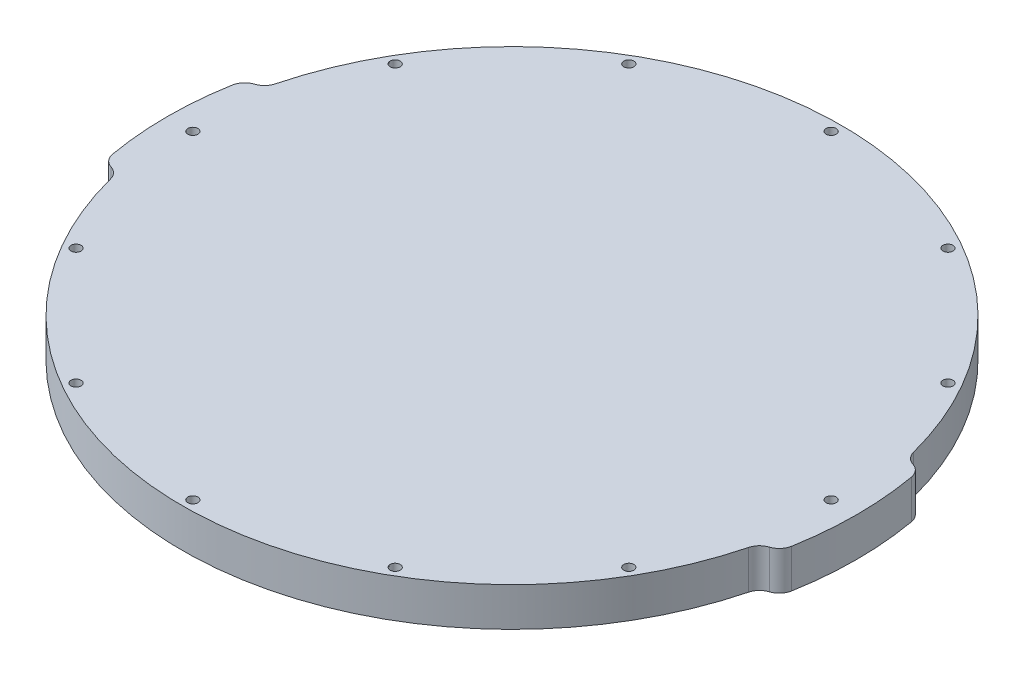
ISO-10303-21;
HEADER;
FILE_DESCRIPTION(('STEP AP214'),'2;1');
FILE_NAME('part.step','',(''),(''),'','','');
FILE_SCHEMA(('AUTOMOTIVE_DESIGN { 1 0 10303 214 1 1 1 1 }'));
ENDSEC;
DATA;
#1=APPLICATION_CONTEXT('core data for automotive mechanical design processes');
#2=APPLICATION_PROTOCOL_DEFINITION('international standard','automotive_design',2000,#1);
#3=PRODUCT_CONTEXT('',#1,'mechanical');
#4=PRODUCT('Part','Part','',(#3));
#5=PRODUCT_RELATED_PRODUCT_CATEGORY('part','',(#4));
#6=PRODUCT_DEFINITION_FORMATION('','',#4);
#7=PRODUCT_DEFINITION_CONTEXT('part definition',#1,'design');
#8=PRODUCT_DEFINITION('design','',#6,#7);
#9=PRODUCT_DEFINITION_SHAPE('','',#8);
#10=(LENGTH_UNIT() NAMED_UNIT(*) SI_UNIT(.MILLI.,.METRE.));
#11=(NAMED_UNIT(*) PLANE_ANGLE_UNIT() SI_UNIT($,.RADIAN.));
#12=(NAMED_UNIT(*) SI_UNIT($,.STERADIAN.) SOLID_ANGLE_UNIT());
#13=UNCERTAINTY_MEASURE_WITH_UNIT(LENGTH_MEASURE(1.E-05),#10,'distance_accuracy_value','');
#14=(GEOMETRIC_REPRESENTATION_CONTEXT(3) GLOBAL_UNCERTAINTY_ASSIGNED_CONTEXT((#13)) GLOBAL_UNIT_ASSIGNED_CONTEXT((#10,
#11,#12)) REPRESENTATION_CONTEXT('',''));
#15=CARTESIAN_POINT('',(0.,0.,0.));
#16=DIRECTION('',(0.,0.,1.));
#17=DIRECTION('',(1.,0.,0.));
#18=AXIS2_PLACEMENT_3D('',#15,#16,#17);
#19=CARTESIAN_POINT('',(-53.1549984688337,12.7,-9.37266038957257));
#20=DIRECTION('',(0.,-1.,0.));
#21=DIRECTION('',(0.,0.,-1.));
#22=AXIS2_PLACEMENT_3D('',#19,#20,#21);
#23=PLANE('',#22);
#24=CARTESIAN_POINT('',(-90.5429559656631,12.7,-52.2749999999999));
#25=DIRECTION('',(0.,1.,0.));
#26=DIRECTION('',(0.,0.,1.));
#27=AXIS2_PLACEMENT_3D('',#24,#25,#26);
#28=CIRCLE('',#27,1.65000000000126);
#29=CARTESIAN_POINT('',(-90.5429559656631,12.7,-50.6249999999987));
#30=VERTEX_POINT('',#29);
#31=EDGE_CURVE('E356',#30,#30,#28,.T.);
#32=ORIENTED_EDGE('',*,*,#31,.F.);
#33=EDGE_LOOP('',(#32));
#34=FACE_BOUND('',#33,.T.);
#35=CARTESIAN_POINT('',(-90.542955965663,12.7,52.2750000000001));
#36=DIRECTION('',(0.,1.,0.));
#37=DIRECTION('',(0.,0.,1.));
#38=AXIS2_PLACEMENT_3D('',#35,#36,#37);
#39=CIRCLE('',#38,1.65000000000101);
#40=CARTESIAN_POINT('',(-90.542955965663,12.7,53.9250000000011));
#41=VERTEX_POINT('',#40);
#42=EDGE_CURVE('E344',#41,#41,#39,.T.);
#43=ORIENTED_EDGE('',*,*,#42,.F.);
#44=EDGE_LOOP('',(#43));
#45=FACE_BOUND('',#44,.T.);
#46=CARTESIAN_POINT('',(0.,12.7,104.55));
#47=DIRECTION('',(0.,1.,0.));
#48=DIRECTION('',(0.,0.,1.));
#49=AXIS2_PLACEMENT_3D('',#46,#47,#48);
#50=CIRCLE('',#49,1.65000000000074);
#51=CARTESIAN_POINT('',(0.,12.7,106.200000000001));
#52=VERTEX_POINT('',#51);
#53=EDGE_CURVE('E332',#52,#52,#50,.T.);
#54=ORIENTED_EDGE('',*,*,#53,.F.);
#55=EDGE_LOOP('',(#54));
#56=FACE_BOUND('',#55,.T.);
#57=CARTESIAN_POINT('',(90.5429559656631,12.7,52.275));
#58=DIRECTION('',(0.,1.,0.));
#59=DIRECTION('',(0.,0.,1.));
#60=AXIS2_PLACEMENT_3D('',#57,#58,#59);
#61=CIRCLE('',#60,1.65000000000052);
#62=CARTESIAN_POINT('',(90.5429559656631,12.7,53.9250000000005));
#63=VERTEX_POINT('',#62);
#64=EDGE_CURVE('E320',#63,#63,#61,.T.);
#65=ORIENTED_EDGE('',*,*,#64,.F.);
#66=EDGE_LOOP('',(#65));
#67=FACE_BOUND('',#66,.T.);
#68=CARTESIAN_POINT('',(90.5429559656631,12.7,-52.275));
#69=DIRECTION('',(0.,1.,0.));
#70=DIRECTION('',(0.,0.,1.));
#71=AXIS2_PLACEMENT_3D('',#68,#69,#70);
#72=CIRCLE('',#71,1.65000000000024);
#73=CARTESIAN_POINT('',(90.5429559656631,12.7,-50.6249999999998));
#74=VERTEX_POINT('',#73);
#75=EDGE_CURVE('E308',#74,#74,#72,.T.);
#76=ORIENTED_EDGE('',*,*,#75,.F.);
#77=EDGE_LOOP('',(#76));
#78=FACE_BOUND('',#77,.T.);
#79=CARTESIAN_POINT('',(0.,12.7,-104.55));
#80=DIRECTION('',(0.,1.,0.));
#81=DIRECTION('',(0.,0.,1.));
#82=AXIS2_PLACEMENT_3D('',#79,#80,#81);
#83=CIRCLE('',#82,1.65);
#84=CARTESIAN_POINT('',(0.,12.7,-102.9));
#85=VERTEX_POINT('',#84);
#86=EDGE_CURVE('E276',#85,#85,#83,.T.);
#87=ORIENTED_EDGE('',*,*,#86,.F.);
#88=EDGE_LOOP('',(#87));
#89=FACE_BOUND('',#88,.T.);
#90=CARTESIAN_POINT('',(0.,12.7,0.));
#91=DIRECTION('',(0.,1.,0.));
#92=DIRECTION('',(0.,0.,-1.));
#93=AXIS2_PLACEMENT_3D('',#90,#91,#92);
#94=CIRCLE('',#93,107.95);
#95=CARTESIAN_POINT('',(104.513991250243,12.7,-27.0190327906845));
#96=VERTEX_POINT('',#95);
#97=CARTESIAN_POINT('',(-104.513991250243,12.7,-27.0190327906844));
#98=VERTEX_POINT('',#97);
#99=EDGE_CURVE('E271',#96,#98,#94,.T.);
#100=ORIENTED_EDGE('',*,*,#99,.T.);
#101=CARTESIAN_POINT('',(-109.354843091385,12.7,-28.2704933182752));
#102=DIRECTION('',(0.,-1.,0.));
#103=DIRECTION('',(0.,0.,-1.));
#104=AXIS2_PLACEMENT_3D('',#101,#102,#103);
#105=CIRCLE('',#104,5.);
#106=CARTESIAN_POINT('',(-107.832420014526,12.7,-23.5079070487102));
#107=VERTEX_POINT('',#106);
#108=EDGE_CURVE('E127',#98,#107,#105,.T.);
#109=ORIENTED_EDGE('',*,*,#108,.T.);
#110=CARTESIAN_POINT('',(-106.309996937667,12.7,-18.7453207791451));
#111=DIRECTION('',(0.,1.,0.));
#112=DIRECTION('',(0.,0.,-1.));
#113=AXIS2_PLACEMENT_3D('',#110,#111,#112);
#114=CIRCLE('',#113,5.00000000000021);
#115=CARTESIAN_POINT('',(-111.234035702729,12.7,-19.6135616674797));
#116=VERTEX_POINT('',#115);
#117=EDGE_CURVE('E120',#107,#116,#114,.T.);
#118=ORIENTED_EDGE('',*,*,#117,.T.);
#119=CARTESIAN_POINT('',(0.,12.7,0.));
#120=DIRECTION('',(0.,1.,0.));
#121=DIRECTION('',(0.,0.,-1.));
#122=AXIS2_PLACEMENT_3D('',#119,#120,#121);
#123=CIRCLE('',#122,112.95);
#124=CARTESIAN_POINT('',(-111.234035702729,12.7,19.6135616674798));
#125=VERTEX_POINT('',#124);
#126=EDGE_CURVE('E124',#116,#125,#123,.T.);
#127=ORIENTED_EDGE('',*,*,#126,.T.);
#128=CARTESIAN_POINT('',(-106.309996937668,12.7,18.7453207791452));
#129=DIRECTION('',(0.,1.,0.));
#130=DIRECTION('',(0.,0.,1.));
#131=AXIS2_PLACEMENT_3D('',#128,#129,#130);
#132=CIRCLE('',#131,5.00000000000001);
#133=CARTESIAN_POINT('',(-107.832420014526,12.7,23.5079070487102));
#134=VERTEX_POINT('',#133);
#135=EDGE_CURVE('E140',#125,#134,#132,.T.);
#136=ORIENTED_EDGE('',*,*,#135,.T.);
#137=CARTESIAN_POINT('',(-109.354843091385,12.7,28.2704933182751));
#138=DIRECTION('',(0.,-1.,0.));
#139=DIRECTION('',(0.,0.,-1.));
#140=AXIS2_PLACEMENT_3D('',#137,#138,#139);
#141=CIRCLE('',#140,5.);
#142=CARTESIAN_POINT('',(-104.513991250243,12.7,27.0190327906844));
#143=VERTEX_POINT('',#142);
#144=EDGE_CURVE('E11',#134,#143,#141,.T.);
#145=ORIENTED_EDGE('',*,*,#144,.T.);
#146=CARTESIAN_POINT('',(0.,12.7,-4.92661467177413E-13));
#147=DIRECTION('',(0.,1.,0.));
#148=DIRECTION('',(0.,0.,-1.));
#149=AXIS2_PLACEMENT_3D('',#146,#147,#148);
#150=CIRCLE('',#149,107.95);
#151=CARTESIAN_POINT('',(104.513991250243,12.7,27.0190327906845));
#152=VERTEX_POINT('',#151);
#153=EDGE_CURVE('E258',#143,#152,#150,.T.);
#154=ORIENTED_EDGE('',*,*,#153,.T.);
#155=CARTESIAN_POINT('',(109.354843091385,12.7,28.2704933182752));
#156=DIRECTION('',(0.,-1.,0.));
#157=DIRECTION('',(0.,0.,-1.));
#158=AXIS2_PLACEMENT_3D('',#155,#156,#157);
#159=CIRCLE('',#158,5.);
#160=CARTESIAN_POINT('',(107.832420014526,12.7,23.5079070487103));
#161=VERTEX_POINT('',#160);
#162=EDGE_CURVE('E171',#152,#161,#159,.T.);
#163=ORIENTED_EDGE('',*,*,#162,.T.);
#164=CARTESIAN_POINT('',(106.309996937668,12.7,18.7453207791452));
#165=DIRECTION('',(0.,1.,0.));
#166=DIRECTION('',(0.,0.,-1.));
#167=AXIS2_PLACEMENT_3D('',#164,#165,#166);
#168=CIRCLE('',#167,5.00000000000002);
#169=CARTESIAN_POINT('',(111.234035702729,12.7,19.6135616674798));
#170=VERTEX_POINT('',#169);
#171=EDGE_CURVE('E255',#161,#170,#168,.T.);
#172=ORIENTED_EDGE('',*,*,#171,.T.);
#173=CARTESIAN_POINT('',(-1.29063426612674E-12,12.7,0.));
#174=DIRECTION('',(0.,1.,0.));
#175=DIRECTION('',(0.,0.,1.));
#176=AXIS2_PLACEMENT_3D('',#173,#174,#175);
#177=CIRCLE('',#176,112.950000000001);
#178=CARTESIAN_POINT('',(111.234035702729,12.7,-19.6135616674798));
#179=VERTEX_POINT('',#178);
#180=EDGE_CURVE('E262',#170,#179,#177,.T.);
#181=ORIENTED_EDGE('',*,*,#180,.T.);
#182=CARTESIAN_POINT('',(106.309996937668,12.7,-18.7453207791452));
#183=DIRECTION('',(0.,1.,0.));
#184=DIRECTION('',(0.,0.,1.));
#185=AXIS2_PLACEMENT_3D('',#182,#183,#184);
#186=CIRCLE('',#185,5.);
#187=CARTESIAN_POINT('',(107.832420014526,12.7,-23.5079070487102));
#188=VERTEX_POINT('',#187);
#189=EDGE_CURVE('E264',#179,#188,#186,.T.);
#190=ORIENTED_EDGE('',*,*,#189,.T.);
#191=CARTESIAN_POINT('',(109.354843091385,12.7,-28.2704933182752));
#192=DIRECTION('',(0.,-1.,0.));
#193=DIRECTION('',(0.,0.,-1.));
#194=AXIS2_PLACEMENT_3D('',#191,#192,#193);
#195=CIRCLE('',#194,5.);
#196=EDGE_CURVE('E175',#188,#96,#195,.T.);
#197=ORIENTED_EDGE('',*,*,#196,.T.);
#198=EDGE_LOOP('',(#100,#109,#118,#127,#136,#145,#154,#163,#172,#181,#190,#197));
#199=FACE_BOUND('',#198,.T.);
#200=CARTESIAN_POINT('',(52.275,12.7,-90.5429559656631));
#201=DIRECTION('',(0.,1.,0.));
#202=DIRECTION('',(0.,0.,1.));
#203=AXIS2_PLACEMENT_3D('',#200,#201,#202);
#204=CIRCLE('',#203,1.65000000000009);
#205=CARTESIAN_POINT('',(52.275,12.7,-88.892955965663));
#206=VERTEX_POINT('',#205);
#207=EDGE_CURVE('E302',#206,#206,#204,.T.);
#208=ORIENTED_EDGE('',*,*,#207,.F.);
#209=EDGE_LOOP('',(#208));
#210=FACE_BOUND('',#209,.T.);
#211=CARTESIAN_POINT('',(104.55,12.7,0.));
#212=DIRECTION('',(0.,1.,0.));
#213=DIRECTION('',(0.,0.,1.));
#214=AXIS2_PLACEMENT_3D('',#211,#212,#213);
#215=CIRCLE('',#214,1.65000000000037);
#216=CARTESIAN_POINT('',(104.55,12.7,1.65000000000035));
#217=VERTEX_POINT('',#216);
#218=EDGE_CURVE('E314',#217,#217,#215,.T.);
#219=ORIENTED_EDGE('',*,*,#218,.F.);
#220=EDGE_LOOP('',(#219));
#221=FACE_BOUND('',#220,.T.);
#222=CARTESIAN_POINT('',(52.2750000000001,12.7,90.542955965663));
#223=DIRECTION('',(0.,1.,0.));
#224=DIRECTION('',(0.,0.,1.));
#225=AXIS2_PLACEMENT_3D('',#222,#223,#224);
#226=CIRCLE('',#225,1.65000000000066);
#227=CARTESIAN_POINT('',(52.2750000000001,12.7,92.1929559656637));
#228=VERTEX_POINT('',#227);
#229=EDGE_CURVE('E326',#228,#228,#226,.T.);
#230=ORIENTED_EDGE('',*,*,#229,.F.);
#231=EDGE_LOOP('',(#230));
#232=FACE_BOUND('',#231,.T.);
#233=CARTESIAN_POINT('',(-52.2749999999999,12.7,90.5429559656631));
#234=DIRECTION('',(0.,1.,0.));
#235=DIRECTION('',(0.,0.,1.));
#236=AXIS2_PLACEMENT_3D('',#233,#234,#235);
#237=CIRCLE('',#236,1.65000000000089);
#238=CARTESIAN_POINT('',(-52.2749999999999,12.7,92.192955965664));
#239=VERTEX_POINT('',#238);
#240=EDGE_CURVE('E338',#239,#239,#237,.T.);
#241=ORIENTED_EDGE('',*,*,#240,.F.);
#242=EDGE_LOOP('',(#241));
#243=FACE_BOUND('',#242,.T.);
#244=CARTESIAN_POINT('',(-104.55,12.7,0.));
#245=DIRECTION('',(0.,1.,0.));
#246=DIRECTION('',(0.,0.,1.));
#247=AXIS2_PLACEMENT_3D('',#244,#245,#246);
#248=CIRCLE('',#247,1.65000000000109);
#249=CARTESIAN_POINT('',(-104.55,12.7,1.65000000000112));
#250=VERTEX_POINT('',#249);
#251=EDGE_CURVE('E350',#250,#250,#248,.T.);
#252=ORIENTED_EDGE('',*,*,#251,.F.);
#253=EDGE_LOOP('',(#252));
#254=FACE_BOUND('',#253,.T.);
#255=CARTESIAN_POINT('',(-52.275,12.7,-90.542955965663));
#256=DIRECTION('',(0.,1.,0.));
#257=DIRECTION('',(0.,0.,1.));
#258=AXIS2_PLACEMENT_3D('',#255,#256,#257);
#259=CIRCLE('',#258,1.65000000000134);
#260=CARTESIAN_POINT('',(-52.275,12.7,-88.8929559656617));
#261=VERTEX_POINT('',#260);
#262=EDGE_CURVE('E362',#261,#261,#259,.T.);
#263=ORIENTED_EDGE('',*,*,#262,.F.);
#264=EDGE_LOOP('',(#263));
#265=FACE_BOUND('',#264,.T.);
#266=ADVANCED_FACE('F32',(#34,#45,#56,#67,#78,#89,#199,#210,#221,#232,#243,#254,#265),#23,.F.);
#267=CARTESIAN_POINT('',(-53.1549984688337,0.,-9.37266038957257));
#268=DIRECTION('',(0.,-1.,0.));
#269=DIRECTION('',(0.,0.,-1.));
#270=AXIS2_PLACEMENT_3D('',#267,#268,#269);
#271=PLANE('',#270);
#272=CARTESIAN_POINT('',(-90.5429559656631,0.,-52.2749999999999));
#273=DIRECTION('',(0.,1.,0.));
#274=DIRECTION('',(0.,0.,1.));
#275=AXIS2_PLACEMENT_3D('',#272,#273,#274);
#276=CIRCLE('',#275,1.65000000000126);
#277=CARTESIAN_POINT('',(-90.5429559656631,0.,-50.6249999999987));
#278=VERTEX_POINT('',#277);
#279=EDGE_CURVE('E359',#278,#278,#276,.T.);
#280=ORIENTED_EDGE('',*,*,#279,.T.);
#281=EDGE_LOOP('',(#280));
#282=FACE_BOUND('',#281,.T.);
#283=CARTESIAN_POINT('',(-90.542955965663,0.,52.2750000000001));
#284=DIRECTION('',(0.,1.,0.));
#285=DIRECTION('',(0.,0.,1.));
#286=AXIS2_PLACEMENT_3D('',#283,#284,#285);
#287=CIRCLE('',#286,1.65000000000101);
#288=CARTESIAN_POINT('',(-90.542955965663,0.,53.9250000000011));
#289=VERTEX_POINT('',#288);
#290=EDGE_CURVE('E347',#289,#289,#287,.T.);
#291=ORIENTED_EDGE('',*,*,#290,.T.);
#292=EDGE_LOOP('',(#291));
#293=FACE_BOUND('',#292,.T.);
#294=CARTESIAN_POINT('',(0.,0.,104.55));
#295=DIRECTION('',(0.,1.,0.));
#296=DIRECTION('',(0.,0.,1.));
#297=AXIS2_PLACEMENT_3D('',#294,#295,#296);
#298=CIRCLE('',#297,1.65000000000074);
#299=CARTESIAN_POINT('',(0.,0.,106.200000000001));
#300=VERTEX_POINT('',#299);
#301=EDGE_CURVE('E335',#300,#300,#298,.T.);
#302=ORIENTED_EDGE('',*,*,#301,.T.);
#303=EDGE_LOOP('',(#302));
#304=FACE_BOUND('',#303,.T.);
#305=CARTESIAN_POINT('',(90.5429559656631,0.,52.275));
#306=DIRECTION('',(0.,1.,0.));
#307=DIRECTION('',(0.,0.,1.));
#308=AXIS2_PLACEMENT_3D('',#305,#306,#307);
#309=CIRCLE('',#308,1.65000000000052);
#310=CARTESIAN_POINT('',(90.5429559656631,0.,53.9250000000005));
#311=VERTEX_POINT('',#310);
#312=EDGE_CURVE('E323',#311,#311,#309,.T.);
#313=ORIENTED_EDGE('',*,*,#312,.T.);
#314=EDGE_LOOP('',(#313));
#315=FACE_BOUND('',#314,.T.);
#316=CARTESIAN_POINT('',(90.5429559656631,0.,-52.275));
#317=DIRECTION('',(0.,1.,0.));
#318=DIRECTION('',(0.,0.,1.));
#319=AXIS2_PLACEMENT_3D('',#316,#317,#318);
#320=CIRCLE('',#319,1.65000000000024);
#321=CARTESIAN_POINT('',(90.5429559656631,0.,-50.6249999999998));
#322=VERTEX_POINT('',#321);
#323=EDGE_CURVE('E311',#322,#322,#320,.T.);
#324=ORIENTED_EDGE('',*,*,#323,.T.);
#325=EDGE_LOOP('',(#324));
#326=FACE_BOUND('',#325,.T.);
#327=CARTESIAN_POINT('',(0.,0.,-104.55));
#328=DIRECTION('',(0.,1.,0.));
#329=DIRECTION('',(0.,0.,1.));
#330=AXIS2_PLACEMENT_3D('',#327,#328,#329);
#331=CIRCLE('',#330,1.65);
#332=CARTESIAN_POINT('',(0.,0.,-102.9));
#333=VERTEX_POINT('',#332);
#334=EDGE_CURVE('E299',#333,#333,#331,.T.);
#335=ORIENTED_EDGE('',*,*,#334,.T.);
#336=EDGE_LOOP('',(#335));
#337=FACE_BOUND('',#336,.T.);
#338=CARTESIAN_POINT('',(-106.309996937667,0.,-18.7453207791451));
#339=DIRECTION('',(0.,1.,0.));
#340=DIRECTION('',(0.,0.,-1.));
#341=AXIS2_PLACEMENT_3D('',#338,#339,#340);
#342=CIRCLE('',#341,5.00000000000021);
#343=CARTESIAN_POINT('',(-107.832420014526,0.,-23.5079070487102));
#344=VERTEX_POINT('',#343);
#345=CARTESIAN_POINT('',(-111.234035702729,0.,-19.6135616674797));
#346=VERTEX_POINT('',#345);
#347=EDGE_CURVE('E144',#344,#346,#342,.T.);
#348=ORIENTED_EDGE('',*,*,#347,.F.);
#349=CARTESIAN_POINT('',(-109.354843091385,0.,-28.2704933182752));
#350=DIRECTION('',(0.,-1.,0.));
#351=DIRECTION('',(0.,0.,-1.));
#352=AXIS2_PLACEMENT_3D('',#349,#350,#351);
#353=CIRCLE('',#352,5.);
#354=CARTESIAN_POINT('',(-104.513991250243,0.,-27.0190327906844));
#355=VERTEX_POINT('',#354);
#356=EDGE_CURVE('E177',#344,#355,#353,.F.);
#357=ORIENTED_EDGE('',*,*,#356,.T.);
#358=CARTESIAN_POINT('',(0.,0.,0.));
#359=DIRECTION('',(0.,1.,0.));
#360=DIRECTION('',(0.,0.,-1.));
#361=AXIS2_PLACEMENT_3D('',#358,#359,#360);
#362=CIRCLE('',#361,107.95);
#363=CARTESIAN_POINT('',(104.513991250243,0.,-27.0190327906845));
#364=VERTEX_POINT('',#363);
#365=EDGE_CURVE('E132',#364,#355,#362,.T.);
#366=ORIENTED_EDGE('',*,*,#365,.F.);
#367=CARTESIAN_POINT('',(109.354843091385,0.,-28.2704933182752));
#368=DIRECTION('',(0.,-1.,0.));
#369=DIRECTION('',(0.,0.,-1.));
#370=AXIS2_PLACEMENT_3D('',#367,#368,#369);
#371=CIRCLE('',#370,5.);
#372=CARTESIAN_POINT('',(107.832420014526,0.,-23.5079070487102));
#373=VERTEX_POINT('',#372);
#374=EDGE_CURVE('E173',#364,#373,#371,.F.);
#375=ORIENTED_EDGE('',*,*,#374,.T.);
#376=CARTESIAN_POINT('',(106.309996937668,0.,-18.7453207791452));
#377=DIRECTION('',(0.,1.,0.));
#378=DIRECTION('',(0.,0.,1.));
#379=AXIS2_PLACEMENT_3D('',#376,#377,#378);
#380=CIRCLE('',#379,5.);
#381=CARTESIAN_POINT('',(111.234035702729,0.,-19.6135616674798));
#382=VERTEX_POINT('',#381);
#383=EDGE_CURVE('E189',#382,#373,#380,.T.);
#384=ORIENTED_EDGE('',*,*,#383,.F.);
#385=CARTESIAN_POINT('',(-1.29063426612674E-12,0.,0.));
#386=DIRECTION('',(0.,1.,0.));
#387=DIRECTION('',(0.,0.,1.));
#388=AXIS2_PLACEMENT_3D('',#385,#386,#387);
#389=CIRCLE('',#388,112.950000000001);
#390=CARTESIAN_POINT('',(111.234035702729,0.,19.6135616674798));
#391=VERTEX_POINT('',#390);
#392=EDGE_CURVE('E285',#391,#382,#389,.T.);
#393=ORIENTED_EDGE('',*,*,#392,.F.);
#394=CARTESIAN_POINT('',(106.309996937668,0.,18.7453207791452));
#395=DIRECTION('',(0.,1.,0.));
#396=DIRECTION('',(0.,0.,-1.));
#397=AXIS2_PLACEMENT_3D('',#394,#395,#396);
#398=CIRCLE('',#397,5.00000000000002);
#399=CARTESIAN_POINT('',(107.832420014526,0.,23.5079070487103));
#400=VERTEX_POINT('',#399);
#401=EDGE_CURVE('E283',#400,#391,#398,.T.);
#402=ORIENTED_EDGE('',*,*,#401,.F.);
#403=CARTESIAN_POINT('',(109.354843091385,0.,28.2704933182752));
#404=DIRECTION('',(0.,-1.,0.));
#405=DIRECTION('',(0.,0.,-1.));
#406=AXIS2_PLACEMENT_3D('',#403,#404,#405);
#407=CIRCLE('',#406,5.);
#408=CARTESIAN_POINT('',(104.513991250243,0.,27.0190327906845));
#409=VERTEX_POINT('',#408);
#410=EDGE_CURVE('E169',#400,#409,#407,.F.);
#411=ORIENTED_EDGE('',*,*,#410,.T.);
#412=CARTESIAN_POINT('',(0.,0.,-4.92661467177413E-13));
#413=DIRECTION('',(0.,1.,0.));
#414=DIRECTION('',(0.,0.,-1.));
#415=AXIS2_PLACEMENT_3D('',#412,#413,#414);
#416=CIRCLE('',#415,107.95);
#417=CARTESIAN_POINT('',(-104.513991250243,0.,27.0190327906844));
#418=VERTEX_POINT('',#417);
#419=EDGE_CURVE('E280',#418,#409,#416,.T.);
#420=ORIENTED_EDGE('',*,*,#419,.F.);
#421=CARTESIAN_POINT('',(-109.354843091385,0.,28.2704933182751));
#422=DIRECTION('',(0.,-1.,0.));
#423=DIRECTION('',(0.,0.,-1.));
#424=AXIS2_PLACEMENT_3D('',#421,#422,#423);
#425=CIRCLE('',#424,5.);
#426=CARTESIAN_POINT('',(-107.832420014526,0.,23.5079070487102));
#427=VERTEX_POINT('',#426);
#428=EDGE_CURVE('E40',#418,#427,#425,.F.);
#429=ORIENTED_EDGE('',*,*,#428,.T.);
#430=CARTESIAN_POINT('',(-106.309996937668,0.,18.7453207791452));
#431=DIRECTION('',(0.,1.,0.));
#432=DIRECTION('',(0.,0.,1.));
#433=AXIS2_PLACEMENT_3D('',#430,#431,#432);
#434=CIRCLE('',#433,5.00000000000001);
#435=CARTESIAN_POINT('',(-111.234035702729,0.,19.6135616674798));
#436=VERTEX_POINT('',#435);
#437=EDGE_CURVE('E278',#436,#427,#434,.T.);
#438=ORIENTED_EDGE('',*,*,#437,.F.);
#439=CARTESIAN_POINT('',(0.,0.,0.));
#440=DIRECTION('',(0.,1.,0.));
#441=DIRECTION('',(0.,0.,-1.));
#442=AXIS2_PLACEMENT_3D('',#439,#440,#441);
#443=CIRCLE('',#442,112.95);
#444=EDGE_CURVE('E275',#346,#436,#443,.T.);
#445=ORIENTED_EDGE('',*,*,#444,.F.);
#446=EDGE_LOOP('',(#348,#357,#366,#375,#384,#393,#402,#411,#420,#429,#438,#445));
#447=FACE_BOUND('',#446,.T.);
#448=CARTESIAN_POINT('',(52.275,0.,-90.5429559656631));
#449=DIRECTION('',(0.,1.,0.));
#450=DIRECTION('',(0.,0.,1.));
#451=AXIS2_PLACEMENT_3D('',#448,#449,#450);
#452=CIRCLE('',#451,1.65000000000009);
#453=CARTESIAN_POINT('',(52.275,0.,-88.892955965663));
#454=VERTEX_POINT('',#453);
#455=EDGE_CURVE('E305',#454,#454,#452,.T.);
#456=ORIENTED_EDGE('',*,*,#455,.T.);
#457=EDGE_LOOP('',(#456));
#458=FACE_BOUND('',#457,.T.);
#459=CARTESIAN_POINT('',(104.55,0.,0.));
#460=DIRECTION('',(0.,1.,0.));
#461=DIRECTION('',(0.,0.,1.));
#462=AXIS2_PLACEMENT_3D('',#459,#460,#461);
#463=CIRCLE('',#462,1.65000000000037);
#464=CARTESIAN_POINT('',(104.55,0.,1.65000000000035));
#465=VERTEX_POINT('',#464);
#466=EDGE_CURVE('E317',#465,#465,#463,.T.);
#467=ORIENTED_EDGE('',*,*,#466,.T.);
#468=EDGE_LOOP('',(#467));
#469=FACE_BOUND('',#468,.T.);
#470=CARTESIAN_POINT('',(52.2750000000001,0.,90.542955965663));
#471=DIRECTION('',(0.,1.,0.));
#472=DIRECTION('',(0.,0.,1.));
#473=AXIS2_PLACEMENT_3D('',#470,#471,#472);
#474=CIRCLE('',#473,1.65000000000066);
#475=CARTESIAN_POINT('',(52.2750000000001,0.,92.1929559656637));
#476=VERTEX_POINT('',#475);
#477=EDGE_CURVE('E329',#476,#476,#474,.T.);
#478=ORIENTED_EDGE('',*,*,#477,.T.);
#479=EDGE_LOOP('',(#478));
#480=FACE_BOUND('',#479,.T.);
#481=CARTESIAN_POINT('',(-52.2749999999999,0.,90.5429559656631));
#482=DIRECTION('',(0.,1.,0.));
#483=DIRECTION('',(0.,0.,1.));
#484=AXIS2_PLACEMENT_3D('',#481,#482,#483);
#485=CIRCLE('',#484,1.65000000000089);
#486=CARTESIAN_POINT('',(-52.2749999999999,0.,92.192955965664));
#487=VERTEX_POINT('',#486);
#488=EDGE_CURVE('E341',#487,#487,#485,.T.);
#489=ORIENTED_EDGE('',*,*,#488,.T.);
#490=EDGE_LOOP('',(#489));
#491=FACE_BOUND('',#490,.T.);
#492=CARTESIAN_POINT('',(-104.55,0.,0.));
#493=DIRECTION('',(0.,1.,0.));
#494=DIRECTION('',(0.,0.,1.));
#495=AXIS2_PLACEMENT_3D('',#492,#493,#494);
#496=CIRCLE('',#495,1.65000000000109);
#497=CARTESIAN_POINT('',(-104.55,0.,1.65000000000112));
#498=VERTEX_POINT('',#497);
#499=EDGE_CURVE('E353',#498,#498,#496,.T.);
#500=ORIENTED_EDGE('',*,*,#499,.T.);
#501=EDGE_LOOP('',(#500));
#502=FACE_BOUND('',#501,.T.);
#503=CARTESIAN_POINT('',(-52.275,0.,-90.542955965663));
#504=DIRECTION('',(0.,1.,0.));
#505=DIRECTION('',(0.,0.,1.));
#506=AXIS2_PLACEMENT_3D('',#503,#504,#505);
#507=CIRCLE('',#506,1.65000000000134);
#508=CARTESIAN_POINT('',(-52.275,0.,-88.8929559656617));
#509=VERTEX_POINT('',#508);
#510=EDGE_CURVE('E365',#509,#509,#507,.T.);
#511=ORIENTED_EDGE('',*,*,#510,.T.);
#512=EDGE_LOOP('',(#511));
#513=FACE_BOUND('',#512,.T.);
#514=ADVANCED_FACE('F181',(#282,#293,#304,#315,#326,#337,#447,#458,#469,#480,#491,#502,#513),
#271,.T.);
#515=CARTESIAN_POINT('',(-106.309996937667,12.7,-18.7453207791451));
#516=DIRECTION('',(0.,-1.,0.));
#517=DIRECTION('',(0.,0.,-1.));
#518=AXIS2_PLACEMENT_3D('',#515,#516,#517);
#519=CYLINDRICAL_SURFACE('',#518,5.00000000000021);
#520=ORIENTED_EDGE('',*,*,#117,.F.);
#521=DIRECTION('',(0.,-1.,0.));
#522=VECTOR('',#521,1.);
#523=CARTESIAN_POINT('',(-107.832420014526,12.7,-23.5079070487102));
#524=LINE('',#523,#522);
#525=EDGE_CURVE('E166',#107,#344,#524,.T.);
#526=ORIENTED_EDGE('',*,*,#525,.T.);
#527=ORIENTED_EDGE('',*,*,#347,.T.);
#528=DIRECTION('',(0.,-1.,0.));
#529=VECTOR('',#528,1.);
#530=CARTESIAN_POINT('',(-111.234035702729,12.7,-19.6135616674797));
#531=LINE('',#530,#529);
#532=EDGE_CURVE('E137',#116,#346,#531,.T.);
#533=ORIENTED_EDGE('',*,*,#532,.F.);
#534=EDGE_LOOP('',(#520,#526,#527,#533));
#535=FACE_BOUND('',#534,.T.);
#536=ADVANCED_FACE('F142',(#535),#519,.T.);
#537=CARTESIAN_POINT('',(0.,12.7,0.));
#538=DIRECTION('',(0.,-1.,0.));
#539=DIRECTION('',(0.,0.,-1.));
#540=AXIS2_PLACEMENT_3D('',#537,#538,#539);
#541=CYLINDRICAL_SURFACE('',#540,112.95);
#542=ORIENTED_EDGE('',*,*,#444,.T.);
#543=DIRECTION('',(0.,-1.,0.));
#544=VECTOR('',#543,1.);
#545=CARTESIAN_POINT('',(-111.234035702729,12.7,19.6135616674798));
#546=LINE('',#545,#544);
#547=EDGE_CURVE('E139',#125,#436,#546,.T.);
#548=ORIENTED_EDGE('',*,*,#547,.F.);
#549=ORIENTED_EDGE('',*,*,#126,.F.);
#550=ORIENTED_EDGE('',*,*,#532,.T.);
#551=EDGE_LOOP('',(#542,#548,#549,#550));
#552=FACE_BOUND('',#551,.T.);
#553=ADVANCED_FACE('F136',(#552),#541,.T.);
#554=CARTESIAN_POINT('',(-106.309996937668,12.7,18.7453207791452));
#555=DIRECTION('',(0.,-1.,0.));
#556=DIRECTION('',(0.,0.,-1.));
#557=AXIS2_PLACEMENT_3D('',#554,#555,#556);
#558=CYLINDRICAL_SURFACE('',#557,5.00000000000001);
#559=ORIENTED_EDGE('',*,*,#437,.T.);
#560=DIRECTION('',(0.,-1.,0.));
#561=VECTOR('',#560,1.);
#562=CARTESIAN_POINT('',(-107.832420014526,12.7,23.5079070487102));
#563=LINE('',#562,#561);
#564=EDGE_CURVE('E47',#427,#134,#563,.F.);
#565=ORIENTED_EDGE('',*,*,#564,.T.);
#566=ORIENTED_EDGE('',*,*,#135,.F.);
#567=ORIENTED_EDGE('',*,*,#547,.T.);
#568=EDGE_LOOP('',(#559,#565,#566,#567));
#569=FACE_BOUND('',#568,.T.);
#570=ADVANCED_FACE('F233',(#569),#558,.T.);
#571=CARTESIAN_POINT('',(0.,12.7,-4.92661467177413E-13));
#572=DIRECTION('',(0.,-1.,0.));
#573=DIRECTION('',(0.,0.,-1.));
#574=AXIS2_PLACEMENT_3D('',#571,#572,#573);
#575=CYLINDRICAL_SURFACE('',#574,107.95);
#576=ORIENTED_EDGE('',*,*,#419,.T.);
#577=DIRECTION('',(0.,-1.,0.));
#578=VECTOR('',#577,1.);
#579=CARTESIAN_POINT('',(104.513991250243,12.7,27.0190327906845));
#580=LINE('',#579,#578);
#581=EDGE_CURVE('E157',#409,#152,#580,.F.);
#582=ORIENTED_EDGE('',*,*,#581,.T.);
#583=ORIENTED_EDGE('',*,*,#153,.F.);
#584=DIRECTION('',(0.,-1.,0.));
#585=VECTOR('',#584,1.);
#586=CARTESIAN_POINT('',(-104.513991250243,12.7,27.0190327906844));
#587=LINE('',#586,#585);
#588=EDGE_CURVE('E149',#143,#418,#587,.T.);
#589=ORIENTED_EDGE('',*,*,#588,.T.);
#590=EDGE_LOOP('',(#576,#582,#583,#589));
#591=FACE_BOUND('',#590,.T.);
#592=ADVANCED_FACE('F229',(#591),#575,.T.);
#593=CARTESIAN_POINT('',(106.309996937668,12.7,18.7453207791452));
#594=DIRECTION('',(0.,-1.,0.));
#595=DIRECTION('',(0.,0.,-1.));
#596=AXIS2_PLACEMENT_3D('',#593,#594,#595);
#597=CYLINDRICAL_SURFACE('',#596,5.00000000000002);
#598=ORIENTED_EDGE('',*,*,#171,.F.);
#599=DIRECTION('',(0.,-1.,0.));
#600=VECTOR('',#599,1.);
#601=CARTESIAN_POINT('',(107.832420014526,12.7,23.5079070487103));
#602=LINE('',#601,#600);
#603=EDGE_CURVE('E146',#161,#400,#602,.T.);
#604=ORIENTED_EDGE('',*,*,#603,.T.);
#605=ORIENTED_EDGE('',*,*,#401,.T.);
#606=DIRECTION('',(0.,-1.,0.));
#607=VECTOR('',#606,1.);
#608=CARTESIAN_POINT('',(111.234035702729,12.7,19.6135616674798));
#609=LINE('',#608,#607);
#610=EDGE_CURVE('E151',#170,#391,#609,.T.);
#611=ORIENTED_EDGE('',*,*,#610,.F.);
#612=EDGE_LOOP('',(#598,#604,#605,#611));
#613=FACE_BOUND('',#612,.T.);
#614=ADVANCED_FACE('F225',(#613),#597,.T.);
#615=CARTESIAN_POINT('',(-1.29063426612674E-12,12.7,0.));
#616=DIRECTION('',(0.,-1.,0.));
#617=DIRECTION('',(0.,0.,-1.));
#618=AXIS2_PLACEMENT_3D('',#615,#616,#617);
#619=CYLINDRICAL_SURFACE('',#618,112.950000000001);
#620=ORIENTED_EDGE('',*,*,#392,.T.);
#621=DIRECTION('',(0.,-1.,0.));
#622=VECTOR('',#621,1.);
#623=CARTESIAN_POINT('',(111.234035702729,12.7,-19.6135616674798));
#624=LINE('',#623,#622);
#625=EDGE_CURVE('E273',#179,#382,#624,.T.);
#626=ORIENTED_EDGE('',*,*,#625,.F.);
#627=ORIENTED_EDGE('',*,*,#180,.F.);
#628=ORIENTED_EDGE('',*,*,#610,.T.);
#629=EDGE_LOOP('',(#620,#626,#627,#628));
#630=FACE_BOUND('',#629,.T.);
#631=ADVANCED_FACE('F221',(#630),#619,.T.);
#632=CARTESIAN_POINT('',(106.309996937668,12.7,-18.7453207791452));
#633=DIRECTION('',(0.,-1.,0.));
#634=DIRECTION('',(0.,0.,-1.));
#635=AXIS2_PLACEMENT_3D('',#632,#633,#634);
#636=CYLINDRICAL_SURFACE('',#635,5.);
#637=ORIENTED_EDGE('',*,*,#383,.T.);
#638=DIRECTION('',(0.,-1.,0.));
#639=VECTOR('',#638,1.);
#640=CARTESIAN_POINT('',(107.832420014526,12.7,-23.5079070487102));
#641=LINE('',#640,#639);
#642=EDGE_CURVE('E164',#373,#188,#641,.F.);
#643=ORIENTED_EDGE('',*,*,#642,.T.);
#644=ORIENTED_EDGE('',*,*,#189,.F.);
#645=ORIENTED_EDGE('',*,*,#625,.T.);
#646=EDGE_LOOP('',(#637,#643,#644,#645));
#647=FACE_BOUND('',#646,.T.);
#648=ADVANCED_FACE('F218',(#647),#636,.T.);
#649=CARTESIAN_POINT('',(0.,12.7,0.));
#650=DIRECTION('',(0.,-1.,0.));
#651=DIRECTION('',(0.,0.,-1.));
#652=AXIS2_PLACEMENT_3D('',#649,#650,#651);
#653=CYLINDRICAL_SURFACE('',#652,107.95);
#654=ORIENTED_EDGE('',*,*,#99,.F.);
#655=DIRECTION('',(0.,-1.,0.));
#656=VECTOR('',#655,1.);
#657=CARTESIAN_POINT('',(104.513991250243,12.7,-27.0190327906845));
#658=LINE('',#657,#656);
#659=EDGE_CURVE('E161',#96,#364,#658,.T.);
#660=ORIENTED_EDGE('',*,*,#659,.T.);
#661=ORIENTED_EDGE('',*,*,#365,.T.);
#662=DIRECTION('',(0.,-1.,0.));
#663=VECTOR('',#662,1.);
#664=CARTESIAN_POINT('',(-104.513991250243,12.7,-27.0190327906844));
#665=LINE('',#664,#663);
#666=EDGE_CURVE('E159',#355,#98,#665,.F.);
#667=ORIENTED_EDGE('',*,*,#666,.T.);
#668=EDGE_LOOP('',(#654,#660,#661,#667));
#669=FACE_BOUND('',#668,.T.);
#670=ADVANCED_FACE('F187',(#669),#653,.T.);
#671=CARTESIAN_POINT('',(0.,12.7,-104.55));
#672=DIRECTION('',(0.,-1.,0.));
#673=DIRECTION('',(0.,0.,-1.));
#674=AXIS2_PLACEMENT_3D('',#671,#672,#673);
#675=CYLINDRICAL_SURFACE('',#674,1.65);
#676=ORIENTED_EDGE('',*,*,#86,.T.);
#677=EDGE_LOOP('',(#676));
#678=FACE_BOUND('',#677,.T.);
#679=ORIENTED_EDGE('',*,*,#334,.F.);
#680=EDGE_LOOP('',(#679));
#681=FACE_BOUND('',#680,.T.);
#682=ADVANCED_FACE('F213',(#678,#681),#675,.F.);
#683=CARTESIAN_POINT('',(52.275,12.7,-90.5429559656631));
#684=DIRECTION('',(0.,-1.,0.));
#685=DIRECTION('',(0.,0.,-1.));
#686=AXIS2_PLACEMENT_3D('',#683,#684,#685);
#687=CYLINDRICAL_SURFACE('',#686,1.65000000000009);
#688=ORIENTED_EDGE('',*,*,#207,.T.);
#689=EDGE_LOOP('',(#688));
#690=FACE_BOUND('',#689,.T.);
#691=ORIENTED_EDGE('',*,*,#455,.F.);
#692=EDGE_LOOP('',(#691));
#693=FACE_BOUND('',#692,.T.);
#694=ADVANCED_FACE('F392',(#690,#693),#687,.F.);
#695=CARTESIAN_POINT('',(90.5429559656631,12.7,-52.275));
#696=DIRECTION('',(0.,-1.,0.));
#697=DIRECTION('',(0.,0.,-1.));
#698=AXIS2_PLACEMENT_3D('',#695,#696,#697);
#699=CYLINDRICAL_SURFACE('',#698,1.65000000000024);
#700=ORIENTED_EDGE('',*,*,#75,.T.);
#701=EDGE_LOOP('',(#700));
#702=FACE_BOUND('',#701,.T.);
#703=ORIENTED_EDGE('',*,*,#323,.F.);
#704=EDGE_LOOP('',(#703));
#705=FACE_BOUND('',#704,.T.);
#706=ADVANCED_FACE('F397',(#702,#705),#699,.F.);
#707=CARTESIAN_POINT('',(104.55,12.7,0.));
#708=DIRECTION('',(0.,-1.,0.));
#709=DIRECTION('',(0.,0.,-1.));
#710=AXIS2_PLACEMENT_3D('',#707,#708,#709);
#711=CYLINDRICAL_SURFACE('',#710,1.65000000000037);
#712=ORIENTED_EDGE('',*,*,#218,.T.);
#713=EDGE_LOOP('',(#712));
#714=FACE_BOUND('',#713,.T.);
#715=ORIENTED_EDGE('',*,*,#466,.F.);
#716=EDGE_LOOP('',(#715));
#717=FACE_BOUND('',#716,.T.);
#718=ADVANCED_FACE('F404',(#714,#717),#711,.F.);
#719=CARTESIAN_POINT('',(90.5429559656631,12.7,52.275));
#720=DIRECTION('',(0.,-1.,0.));
#721=DIRECTION('',(0.,0.,-1.));
#722=AXIS2_PLACEMENT_3D('',#719,#720,#721);
#723=CYLINDRICAL_SURFACE('',#722,1.65000000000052);
#724=ORIENTED_EDGE('',*,*,#64,.T.);
#725=EDGE_LOOP('',(#724));
#726=FACE_BOUND('',#725,.T.);
#727=ORIENTED_EDGE('',*,*,#312,.F.);
#728=EDGE_LOOP('',(#727));
#729=FACE_BOUND('',#728,.T.);
#730=ADVANCED_FACE('F411',(#726,#729),#723,.F.);
#731=CARTESIAN_POINT('',(52.2750000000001,12.7,90.542955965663));
#732=DIRECTION('',(0.,-1.,0.));
#733=DIRECTION('',(0.,0.,-1.));
#734=AXIS2_PLACEMENT_3D('',#731,#732,#733);
#735=CYLINDRICAL_SURFACE('',#734,1.65000000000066);
#736=ORIENTED_EDGE('',*,*,#229,.T.);
#737=EDGE_LOOP('',(#736));
#738=FACE_BOUND('',#737,.T.);
#739=ORIENTED_EDGE('',*,*,#477,.F.);
#740=EDGE_LOOP('',(#739));
#741=FACE_BOUND('',#740,.T.);
#742=ADVANCED_FACE('F415',(#738,#741),#735,.F.);
#743=CARTESIAN_POINT('',(0.,12.7,104.55));
#744=DIRECTION('',(0.,-1.,0.));
#745=DIRECTION('',(0.,0.,-1.));
#746=AXIS2_PLACEMENT_3D('',#743,#744,#745);
#747=CYLINDRICAL_SURFACE('',#746,1.65000000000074);
#748=ORIENTED_EDGE('',*,*,#53,.T.);
#749=EDGE_LOOP('',(#748));
#750=FACE_BOUND('',#749,.T.);
#751=ORIENTED_EDGE('',*,*,#301,.F.);
#752=EDGE_LOOP('',(#751));
#753=FACE_BOUND('',#752,.T.);
#754=ADVANCED_FACE('F419',(#750,#753),#747,.F.);
#755=CARTESIAN_POINT('',(-52.2749999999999,12.7,90.5429559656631));
#756=DIRECTION('',(0.,-1.,0.));
#757=DIRECTION('',(0.,0.,-1.));
#758=AXIS2_PLACEMENT_3D('',#755,#756,#757);
#759=CYLINDRICAL_SURFACE('',#758,1.65000000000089);
#760=ORIENTED_EDGE('',*,*,#240,.T.);
#761=EDGE_LOOP('',(#760));
#762=FACE_BOUND('',#761,.T.);
#763=ORIENTED_EDGE('',*,*,#488,.F.);
#764=EDGE_LOOP('',(#763));
#765=FACE_BOUND('',#764,.T.);
#766=ADVANCED_FACE('F423',(#762,#765),#759,.F.);
#767=CARTESIAN_POINT('',(-90.542955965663,12.7,52.2750000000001));
#768=DIRECTION('',(0.,-1.,0.));
#769=DIRECTION('',(0.,0.,-1.));
#770=AXIS2_PLACEMENT_3D('',#767,#768,#769);
#771=CYLINDRICAL_SURFACE('',#770,1.65000000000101);
#772=ORIENTED_EDGE('',*,*,#42,.T.);
#773=EDGE_LOOP('',(#772));
#774=FACE_BOUND('',#773,.T.);
#775=ORIENTED_EDGE('',*,*,#290,.F.);
#776=EDGE_LOOP('',(#775));
#777=FACE_BOUND('',#776,.T.);
#778=ADVANCED_FACE('F427',(#774,#777),#771,.F.);
#779=CARTESIAN_POINT('',(-104.55,12.7,0.));
#780=DIRECTION('',(0.,-1.,0.));
#781=DIRECTION('',(0.,0.,-1.));
#782=AXIS2_PLACEMENT_3D('',#779,#780,#781);
#783=CYLINDRICAL_SURFACE('',#782,1.65000000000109);
#784=ORIENTED_EDGE('',*,*,#251,.T.);
#785=EDGE_LOOP('',(#784));
#786=FACE_BOUND('',#785,.T.);
#787=ORIENTED_EDGE('',*,*,#499,.F.);
#788=EDGE_LOOP('',(#787));
#789=FACE_BOUND('',#788,.T.);
#790=ADVANCED_FACE('F377',(#786,#789),#783,.F.);
#791=CARTESIAN_POINT('',(-90.5429559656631,12.7,-52.2749999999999));
#792=DIRECTION('',(0.,-1.,0.));
#793=DIRECTION('',(0.,0.,-1.));
#794=AXIS2_PLACEMENT_3D('',#791,#792,#793);
#795=CYLINDRICAL_SURFACE('',#794,1.65000000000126);
#796=ORIENTED_EDGE('',*,*,#31,.T.);
#797=EDGE_LOOP('',(#796));
#798=FACE_BOUND('',#797,.T.);
#799=ORIENTED_EDGE('',*,*,#279,.F.);
#800=EDGE_LOOP('',(#799));
#801=FACE_BOUND('',#800,.T.);
#802=ADVANCED_FACE('F247',(#798,#801),#795,.F.);
#803=CARTESIAN_POINT('',(-52.275,12.7,-90.542955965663));
#804=DIRECTION('',(0.,-1.,0.));
#805=DIRECTION('',(0.,0.,-1.));
#806=AXIS2_PLACEMENT_3D('',#803,#804,#805);
#807=CYLINDRICAL_SURFACE('',#806,1.65000000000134);
#808=ORIENTED_EDGE('',*,*,#262,.T.);
#809=EDGE_LOOP('',(#808));
#810=FACE_BOUND('',#809,.T.);
#811=ORIENTED_EDGE('',*,*,#510,.F.);
#812=EDGE_LOOP('',(#811));
#813=FACE_BOUND('',#812,.T.);
#814=ADVANCED_FACE('F242',(#810,#813),#807,.F.);
#815=CARTESIAN_POINT('',(109.354843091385,12.7,28.2704933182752));
#816=DIRECTION('',(0.,1.,0.));
#817=DIRECTION('',(0.,0.,1.));
#818=AXIS2_PLACEMENT_3D('',#815,#816,#817);
#819=CYLINDRICAL_SURFACE('',#818,5.);
#820=ORIENTED_EDGE('',*,*,#162,.F.);
#821=ORIENTED_EDGE('',*,*,#581,.F.);
#822=ORIENTED_EDGE('',*,*,#410,.F.);
#823=ORIENTED_EDGE('',*,*,#603,.F.);
#824=EDGE_LOOP('',(#820,#821,#822,#823));
#825=FACE_BOUND('',#824,.T.);
#826=ADVANCED_FACE('F199',(#825),#819,.F.);
#827=CARTESIAN_POINT('',(109.354843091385,12.7,-28.2704933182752));
#828=DIRECTION('',(0.,1.,0.));
#829=DIRECTION('',(0.,0.,1.));
#830=AXIS2_PLACEMENT_3D('',#827,#828,#829);
#831=CYLINDRICAL_SURFACE('',#830,5.);
#832=ORIENTED_EDGE('',*,*,#196,.F.);
#833=ORIENTED_EDGE('',*,*,#642,.F.);
#834=ORIENTED_EDGE('',*,*,#374,.F.);
#835=ORIENTED_EDGE('',*,*,#659,.F.);
#836=EDGE_LOOP('',(#832,#833,#834,#835));
#837=FACE_BOUND('',#836,.T.);
#838=ADVANCED_FACE('F193',(#837),#831,.F.);
#839=CARTESIAN_POINT('',(-109.354843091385,12.7,-28.2704933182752));
#840=DIRECTION('',(0.,1.,0.));
#841=DIRECTION('',(0.,0.,1.));
#842=AXIS2_PLACEMENT_3D('',#839,#840,#841);
#843=CYLINDRICAL_SURFACE('',#842,5.);
#844=ORIENTED_EDGE('',*,*,#108,.F.);
#845=ORIENTED_EDGE('',*,*,#666,.F.);
#846=ORIENTED_EDGE('',*,*,#356,.F.);
#847=ORIENTED_EDGE('',*,*,#525,.F.);
#848=EDGE_LOOP('',(#844,#845,#846,#847));
#849=FACE_BOUND('',#848,.T.);
#850=ADVANCED_FACE('F191',(#849),#843,.F.);
#851=CARTESIAN_POINT('',(-109.354843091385,12.7,28.2704933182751));
#852=DIRECTION('',(0.,1.,0.));
#853=DIRECTION('',(0.,0.,1.));
#854=AXIS2_PLACEMENT_3D('',#851,#852,#853);
#855=CYLINDRICAL_SURFACE('',#854,5.);
#856=ORIENTED_EDGE('',*,*,#144,.F.);
#857=ORIENTED_EDGE('',*,*,#564,.F.);
#858=ORIENTED_EDGE('',*,*,#428,.F.);
#859=ORIENTED_EDGE('',*,*,#588,.F.);
#860=EDGE_LOOP('',(#856,#857,#858,#859));
#861=FACE_BOUND('',#860,.T.);
#862=ADVANCED_FACE('F34',(#861),#855,.F.);
#863=CLOSED_SHELL('',(#266,#514,#536,#553,#570,#592,#614,#631,#648,#670,#682,#694,#706,#718,
#730,#742,#754,#766,#778,#790,#802,#814,#826,#838,#850,#862));
#864=MANIFOLD_SOLID_BREP('B2',#863);
#865=ADVANCED_BREP_SHAPE_REPRESENTATION('',(#18,#864),#14);
#866=SHAPE_DEFINITION_REPRESENTATION(#9,#865);
ENDSEC;
END-ISO-10303-21;
